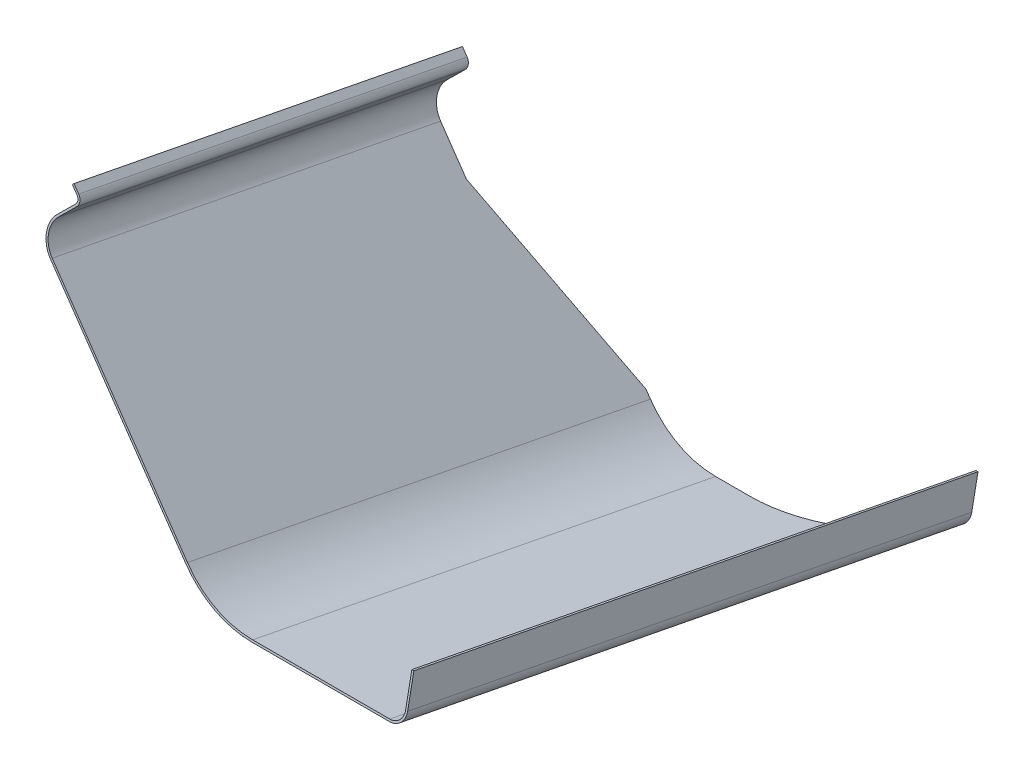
ISO-10303-21;
HEADER;
FILE_DESCRIPTION(('STEP AP214'),'2;1');
FILE_NAME('part.step','',(''),(''),'','','');
FILE_SCHEMA(('AUTOMOTIVE_DESIGN { 1 0 10303 214 1 1 1 1 }'));
ENDSEC;
DATA;
#1=APPLICATION_CONTEXT('core data for automotive mechanical design processes');
#2=APPLICATION_PROTOCOL_DEFINITION('international standard','automotive_design',2000,#1);
#3=PRODUCT_CONTEXT('',#1,'mechanical');
#4=PRODUCT('Part','Part','',(#3));
#5=PRODUCT_RELATED_PRODUCT_CATEGORY('part','',(#4));
#6=PRODUCT_DEFINITION_FORMATION('','',#4);
#7=PRODUCT_DEFINITION_CONTEXT('part definition',#1,'design');
#8=PRODUCT_DEFINITION('design','',#6,#7);
#9=PRODUCT_DEFINITION_SHAPE('','',#8);
#10=(LENGTH_UNIT() NAMED_UNIT(*) SI_UNIT(.MILLI.,.METRE.));
#11=(NAMED_UNIT(*) PLANE_ANGLE_UNIT() SI_UNIT($,.RADIAN.));
#12=(NAMED_UNIT(*) SI_UNIT($,.STERADIAN.) SOLID_ANGLE_UNIT());
#13=UNCERTAINTY_MEASURE_WITH_UNIT(LENGTH_MEASURE(1.E-05),#10,'distance_accuracy_value','');
#14=(GEOMETRIC_REPRESENTATION_CONTEXT(3) GLOBAL_UNCERTAINTY_ASSIGNED_CONTEXT((#13)) GLOBAL_UNIT_ASSIGNED_CONTEXT((#10,
#11,#12)) REPRESENTATION_CONTEXT('',''));
#15=CARTESIAN_POINT('',(0.,0.,0.));
#16=DIRECTION('',(0.,0.,1.));
#17=DIRECTION('',(1.,0.,0.));
#18=AXIS2_PLACEMENT_3D('',#15,#16,#17);
#19=CARTESIAN_POINT('',(-782.532323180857,-384.378000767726,-358.482205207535));
#20=DIRECTION('',(0.,0.190808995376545,0.981627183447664));
#21=DIRECTION('',(0.,-0.981627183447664,0.190808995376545));
#22=AXIS2_PLACEMENT_3D('',#19,#20,#21);
#23=PLANE('',#22);
#24=DIRECTION('',(0.,-0.981627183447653,0.190808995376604));
#25=VECTOR('',#24,1.);
#26=CARTESIAN_POINT('',(-782.532323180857,-324.520915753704,-370.117243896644));
#27=LINE('',#26,#25);
#28=CARTESIAN_POINT('',(-782.532323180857,-324.520915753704,-370.117243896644));
#29=VERTEX_POINT('',#28);
#30=CARTESIAN_POINT('',(-782.532323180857,-325.226136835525,-369.980162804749));
#31=VERTEX_POINT('',#30);
#32=EDGE_CURVE('E219',#29,#31,#27,.T.);
#33=ORIENTED_EDGE('',*,*,#32,.T.);
#34=DIRECTION('',(0.707106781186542,-0.694115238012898,0.134922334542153));
#35=VECTOR('',#34,1.);
#36=CARTESIAN_POINT('',(-790.791429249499,-317.118773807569,-371.556074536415));
#37=LINE('',#36,#35);
#38=CARTESIAN_POINT('',(-790.791429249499,-317.118773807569,-371.556074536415));
#39=VERTEX_POINT('',#38);
#40=EDGE_CURVE('E221',#39,#31,#37,.T.);
#41=ORIENTED_EDGE('',*,*,#40,.F.);
#42=CARTESIAN_POINT('',(-786.301301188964,-312.711142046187,-372.412831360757));
#43=DIRECTION('',(0.,-0.190808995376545,-0.981627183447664));
#44=DIRECTION('',(0.,0.981627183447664,-0.190808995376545));
#45=AXIS2_PLACEMENT_3D('',#42,#43,#44);
#46=CIRCLE('',#45,6.35000000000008);
#47=CARTESIAN_POINT('',(-790.791429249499,-308.303510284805,-373.2695881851));
#48=VERTEX_POINT('',#47);
#49=EDGE_CURVE('E312',#48,#39,#46,.F.);
#50=ORIENTED_EDGE('',*,*,#49,.F.);
#51=DIRECTION('',(-0.707106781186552,-0.694115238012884,0.134922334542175));
#52=VECTOR('',#51,1.);
#53=CARTESIAN_POINT('',(-786.983060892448,-304.565112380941,-373.996259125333));
#54=LINE('',#53,#52);
#55=CARTESIAN_POINT('',(-786.983060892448,-304.565112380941,-373.996259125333));
#56=VERTEX_POINT('',#55);
#57=EDGE_CURVE('E245',#56,#48,#54,.T.);
#58=ORIENTED_EDGE('',*,*,#57,.F.);
#59=CARTESIAN_POINT('',(-787.881086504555,-303.683586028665,-374.167610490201));
#60=DIRECTION('',(0.,-0.190808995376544,-0.981627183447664));
#61=DIRECTION('',(0.,0.981627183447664,-0.190808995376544));
#62=AXIS2_PLACEMENT_3D('',#59,#60,#61);
#63=CIRCLE('',#62,1.26999999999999);
#64=CARTESIAN_POINT('',(-786.983060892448,-302.802059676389,-374.33896185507));
#65=VERTEX_POINT('',#64);
#66=EDGE_CURVE('E249',#65,#56,#63,.T.);
#67=ORIENTED_EDGE('',*,*,#66,.F.);
#68=DIRECTION('',(0.707106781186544,-0.694115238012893,0.134922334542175));
#69=VECTOR('',#68,1.);
#70=CARTESIAN_POINT('',(-788.419901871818,-301.391617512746,-374.61312403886));
#71=LINE('',#70,#69);
#72=CARTESIAN_POINT('',(-788.419901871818,-301.391617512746,-374.61312403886));
#73=VERTEX_POINT('',#72);
#74=EDGE_CURVE('E250',#73,#65,#71,.T.);
#75=ORIENTED_EDGE('',*,*,#74,.F.);
#76=DIRECTION('',(-0.707106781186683,-0.694115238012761,0.134922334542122));
#77=VECTOR('',#76,1.);
#78=CARTESIAN_POINT('',(-788.060691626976,-301.039006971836,-374.681664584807));
#79=LINE('',#78,#77);
#80=CARTESIAN_POINT('',(-788.060691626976,-301.039006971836,-374.681664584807));
#81=VERTEX_POINT('',#80);
#82=EDGE_CURVE('E257',#81,#73,#79,.T.);
#83=ORIENTED_EDGE('',*,*,#82,.F.);
#84=DIRECTION('',(-0.707106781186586,0.694115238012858,-0.134922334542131));
#85=VECTOR('',#84,1.);
#86=CARTESIAN_POINT('',(-786.623850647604,-302.449449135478,-374.407502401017));
#87=LINE('',#86,#85);
#88=CARTESIAN_POINT('',(-786.623850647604,-302.449449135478,-374.407502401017));
#89=VERTEX_POINT('',#88);
#90=EDGE_CURVE('E263',#89,#81,#87,.T.);
#91=ORIENTED_EDGE('',*,*,#90,.F.);
#92=CARTESIAN_POINT('',(-787.881086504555,-303.683586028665,-374.167610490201));
#93=DIRECTION('',(0.,-0.190808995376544,-0.981627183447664));
#94=DIRECTION('',(0.,0.981627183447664,-0.190808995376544));
#95=AXIS2_PLACEMENT_3D('',#92,#93,#94);
#96=CIRCLE('',#95,1.77799999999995);
#97=CARTESIAN_POINT('',(-786.623850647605,-304.917722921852,-373.927718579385));
#98=VERTEX_POINT('',#97);
#99=EDGE_CURVE('E161',#98,#89,#96,.F.);
#100=ORIENTED_EDGE('',*,*,#99,.F.);
#101=DIRECTION('',(0.707106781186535,0.694115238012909,-0.134922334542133));
#102=VECTOR('',#101,1.);
#103=CARTESIAN_POINT('',(-790.432219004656,-308.656120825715,-373.201047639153));
#104=LINE('',#103,#102);
#105=CARTESIAN_POINT('',(-790.432219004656,-308.656120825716,-373.201047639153));
#106=VERTEX_POINT('',#105);
#107=EDGE_CURVE('E155',#106,#98,#104,.T.);
#108=ORIENTED_EDGE('',*,*,#107,.F.);
#109=CARTESIAN_POINT('',(-786.301301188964,-312.711142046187,-372.412831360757));
#110=DIRECTION('',(0.,-0.190808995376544,-0.981627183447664));
#111=DIRECTION('',(0.,0.981627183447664,-0.190808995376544));
#112=AXIS2_PLACEMENT_3D('',#109,#110,#111);
#113=CIRCLE('',#112,5.84200000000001);
#114=CARTESIAN_POINT('',(-790.432219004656,-316.766163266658,-371.624615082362));
#115=VERTEX_POINT('',#114);
#116=EDGE_CURVE('E20',#115,#106,#113,.T.);
#117=ORIENTED_EDGE('',*,*,#116,.F.);
#118=DIRECTION('',(-0.707106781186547,0.694115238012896,-0.134922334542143));
#119=VECTOR('',#118,1.);
#120=CARTESIAN_POINT('',(-782.532323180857,-324.520915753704,-370.117243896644));
#121=LINE('',#120,#119);
#122=EDGE_CURVE('E186',#29,#115,#121,.T.);
#123=ORIENTED_EDGE('',*,*,#122,.F.);
#124=EDGE_LOOP('',(#33,#41,#50,#58,#67,#75,#83,#91,#100,#108,#117,#123));
#125=FACE_BOUND('',#124,.T.);
#126=ADVANCED_FACE('F16',(#125),#23,.F.);
#127=CARTESIAN_POINT('',(-697.191345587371,-342.697312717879,-266.377108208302));
#128=DIRECTION('',(0.,-0.190808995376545,-0.981627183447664));
#129=DIRECTION('',(0.,0.981627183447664,-0.190808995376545));
#130=AXIS2_PLACEMENT_3D('',#127,#128,#129);
#131=CYLINDRICAL_SURFACE('',#130,3.80999999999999);
#132=DIRECTION('',(0.,-0.190808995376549,-0.981627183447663));
#133=VECTOR('',#132,1.);
#134=CARTESIAN_POINT('',(-693.381345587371,-342.697312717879,-266.377108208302));
#135=LINE('',#134,#133);
#136=CARTESIAN_POINT('',(-693.381345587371,-342.697312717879,-266.377108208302));
#137=VERTEX_POINT('',#136);
#138=CARTESIAN_POINT('',(-693.381345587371,-369.959147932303,-406.627092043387));
#139=VERTEX_POINT('',#138);
#140=EDGE_CURVE('E204',#137,#139,#135,.T.);
#141=ORIENTED_EDGE('',*,*,#140,.F.);
#142=CARTESIAN_POINT('',(-697.191345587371,-342.697312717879,-266.377108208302));
#143=DIRECTION('',(0.,-0.190808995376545,-0.981627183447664));
#144=DIRECTION('',(0.,0.981627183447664,-0.190808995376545));
#145=AXIS2_PLACEMENT_3D('',#142,#143,#144);
#146=CIRCLE('',#145,3.80999999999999);
#147=CARTESIAN_POINT('',(-697.191345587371,-346.437312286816,-265.650125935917));
#148=VERTEX_POINT('',#147);
#149=EDGE_CURVE('E298',#148,#137,#146,.F.);
#150=ORIENTED_EDGE('',*,*,#149,.F.);
#151=DIRECTION('',(0.,-0.190808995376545,-0.981627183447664));
#152=VECTOR('',#151,1.);
#153=CARTESIAN_POINT('',(-697.191345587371,-346.437312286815,-265.650125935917));
#154=LINE('',#153,#152);
#155=CARTESIAN_POINT('',(-697.191345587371,-373.699147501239,-405.900109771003));
#156=VERTEX_POINT('',#155);
#157=EDGE_CURVE('E209',#156,#148,#154,.F.);
#158=ORIENTED_EDGE('',*,*,#157,.F.);
#159=CARTESIAN_POINT('',(-697.191345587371,-369.959147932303,-406.627092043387));
#160=DIRECTION('',(0.,-0.190808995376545,-0.981627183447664));
#161=DIRECTION('',(0.,0.981627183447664,-0.190808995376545));
#162=AXIS2_PLACEMENT_3D('',#159,#160,#161);
#163=CIRCLE('',#162,3.80999999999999);
#164=EDGE_CURVE('E310',#156,#139,#163,.F.);
#165=ORIENTED_EDGE('',*,*,#164,.T.);
#166=EDGE_LOOP('',(#141,#150,#158,#165));
#167=FACE_BOUND('',#166,.T.);
#168=ADVANCED_FACE('F461',(#167),#131,.T.);
#169=CARTESIAN_POINT('',(-693.381345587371,-342.697312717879,-266.377108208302));
#170=DIRECTION('',(1.,0.,0.));
#171=DIRECTION('',(0.,1.,0.));
#172=AXIS2_PLACEMENT_3D('',#169,#170,#171);
#173=PLANE('',#172);
#174=DIRECTION('',(0.,-0.981627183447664,0.190808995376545));
#175=VECTOR('',#174,1.);
#176=CARTESIAN_POINT('',(-693.381345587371,-315.518055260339,-271.660220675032));
#177=LINE('',#176,#175);
#178=CARTESIAN_POINT('',(-693.381345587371,-334.730907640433,-267.925620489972));
#179=VERTEX_POINT('',#178);
#180=EDGE_CURVE('E199',#137,#179,#177,.F.);
#181=ORIENTED_EDGE('',*,*,#180,.F.);
#182=ORIENTED_EDGE('',*,*,#140,.T.);
#183=DIRECTION('',(0.,-0.981627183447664,0.190808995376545));
#184=VECTOR('',#183,1.);
#185=CARTESIAN_POINT('',(-693.381345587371,-366.396344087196,-407.319630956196));
#186=LINE('',#185,#184);
#187=CARTESIAN_POINT('',(-693.381345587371,-361.992742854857,-408.175604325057));
#188=VERTEX_POINT('',#187);
#189=EDGE_CURVE('E242',#139,#188,#186,.F.);
#190=ORIENTED_EDGE('',*,*,#189,.T.);
#191=DIRECTION('',(0.,0.190808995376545,0.981627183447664));
#192=VECTOR('',#191,1.);
#193=CARTESIAN_POINT('',(-693.381345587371,-334.730907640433,-267.925620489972));
#194=LINE('',#193,#192);
#195=EDGE_CURVE('E192',#179,#188,#194,.F.);
#196=ORIENTED_EDGE('',*,*,#195,.F.);
#197=EDGE_LOOP('',(#181,#182,#190,#196));
#198=FACE_BOUND('',#197,.T.);
#199=ADVANCED_FACE('F696',(#198),#173,.T.);
#200=CARTESIAN_POINT('',(-693.381345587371,-334.730907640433,-267.925620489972));
#201=DIRECTION('',(0.,0.981627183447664,-0.190808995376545));
#202=DIRECTION('',(0.,0.190808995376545,0.981627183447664));
#203=AXIS2_PLACEMENT_3D('',#200,#201,#202);
#204=PLANE('',#203);
#205=DIRECTION('',(1.,0.,0.));
#206=VECTOR('',#205,1.);
#207=CARTESIAN_POINT('',(-751.586870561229,-334.730907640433,-267.925620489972));
#208=LINE('',#207,#206);
#209=CARTESIAN_POINT('',(-693.889345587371,-334.730907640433,-267.925620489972));
#210=VERTEX_POINT('',#209);
#211=EDGE_CURVE('E195',#179,#210,#208,.F.);
#212=ORIENTED_EDGE('',*,*,#211,.F.);
#213=ORIENTED_EDGE('',*,*,#195,.T.);
#214=DIRECTION('',(1.,0.,0.));
#215=VECTOR('',#214,1.);
#216=CARTESIAN_POINT('',(-749.243235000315,-361.992742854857,-408.175604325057));
#217=LINE('',#216,#215);
#218=CARTESIAN_POINT('',(-693.889345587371,-361.992742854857,-408.175604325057));
#219=VERTEX_POINT('',#218);
#220=EDGE_CURVE('E238',#188,#219,#217,.F.);
#221=ORIENTED_EDGE('',*,*,#220,.T.);
#222=DIRECTION('',(0.,-0.190808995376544,-0.981627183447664));
#223=VECTOR('',#222,1.);
#224=CARTESIAN_POINT('',(-693.889345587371,-334.730907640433,-267.925620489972));
#225=LINE('',#224,#223);
#226=EDGE_CURVE('E189',#210,#219,#225,.T.);
#227=ORIENTED_EDGE('',*,*,#226,.F.);
#228=EDGE_LOOP('',(#212,#213,#221,#227));
#229=FACE_BOUND('',#228,.T.);
#230=ADVANCED_FACE('F456',(#229),#204,.T.);
#231=CARTESIAN_POINT('',(-693.889345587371,-334.730907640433,-267.925620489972));
#232=DIRECTION('',(-1.,0.,0.));
#233=DIRECTION('',(0.,-1.,0.));
#234=AXIS2_PLACEMENT_3D('',#231,#232,#233);
#235=PLANE('',#234);
#236=DIRECTION('',(0.,-0.981627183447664,0.190808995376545));
#237=VECTOR('',#236,1.);
#238=CARTESIAN_POINT('',(-693.889345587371,-315.518055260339,-271.660220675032));
#239=LINE('',#238,#237);
#240=CARTESIAN_POINT('',(-693.889345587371,-342.697312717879,-266.377108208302));
#241=VERTEX_POINT('',#240);
#242=EDGE_CURVE('E198',#210,#241,#239,.T.);
#243=ORIENTED_EDGE('',*,*,#242,.F.);
#244=ORIENTED_EDGE('',*,*,#226,.T.);
#245=DIRECTION('',(0.,-0.981627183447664,0.190808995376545));
#246=VECTOR('',#245,1.);
#247=CARTESIAN_POINT('',(-693.889345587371,-366.396344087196,-407.319630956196));
#248=LINE('',#247,#246);
#249=CARTESIAN_POINT('',(-693.889345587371,-369.959147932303,-406.627092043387));
#250=VERTEX_POINT('',#249);
#251=EDGE_CURVE('E241',#219,#250,#248,.T.);
#252=ORIENTED_EDGE('',*,*,#251,.T.);
#253=DIRECTION('',(0.,-0.190808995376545,-0.981627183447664));
#254=VECTOR('',#253,1.);
#255=CARTESIAN_POINT('',(-693.889345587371,-342.697312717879,-266.377108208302));
#256=LINE('',#255,#254);
#257=EDGE_CURVE('E174',#241,#250,#256,.T.);
#258=ORIENTED_EDGE('',*,*,#257,.F.);
#259=EDGE_LOOP('',(#243,#244,#252,#258));
#260=FACE_BOUND('',#259,.T.);
#261=ADVANCED_FACE('F438',(#260),#235,.T.);
#262=CARTESIAN_POINT('',(-786.301301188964,-293.942040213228,-275.85417314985));
#263=DIRECTION('',(0.,-0.190808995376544,-0.981627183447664));
#264=DIRECTION('',(0.,0.981627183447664,-0.190808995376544));
#265=AXIS2_PLACEMENT_3D('',#262,#263,#264);
#266=CYLINDRICAL_SURFACE('',#265,5.84200000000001);
#267=DIRECTION('',(0.,-0.190808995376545,-0.981627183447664));
#268=VECTOR('',#267,1.);
#269=CARTESIAN_POINT('',(-790.432219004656,-289.887018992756,-276.642389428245));
#270=LINE('',#269,#268);
#271=CARTESIAN_POINT('',(-790.432219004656,-289.887018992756,-276.642389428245));
#272=VERTEX_POINT('',#271);
#273=EDGE_CURVE('E166',#272,#106,#270,.T.);
#274=ORIENTED_EDGE('',*,*,#273,.F.);
#275=CARTESIAN_POINT('',(-786.301301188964,-293.942040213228,-275.85417314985));
#276=DIRECTION('',(0.,-0.190808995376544,-0.981627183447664));
#277=DIRECTION('',(0.,0.981627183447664,-0.190808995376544));
#278=AXIS2_PLACEMENT_3D('',#275,#276,#277);
#279=CIRCLE('',#278,5.84200000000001);
#280=CARTESIAN_POINT('',(-790.432219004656,-297.997061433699,-275.065956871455));
#281=VERTEX_POINT('',#280);
#282=EDGE_CURVE('E293',#281,#272,#279,.T.);
#283=ORIENTED_EDGE('',*,*,#282,.F.);
#284=DIRECTION('',(0.,0.190808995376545,0.981627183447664));
#285=VECTOR('',#284,1.);
#286=CARTESIAN_POINT('',(-790.432219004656,-316.766163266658,-371.624615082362));
#287=LINE('',#286,#285);
#288=EDGE_CURVE('E172',#115,#281,#287,.T.);
#289=ORIENTED_EDGE('',*,*,#288,.F.);
#290=ORIENTED_EDGE('',*,*,#116,.T.);
#291=EDGE_LOOP('',(#274,#283,#289,#290));
#292=FACE_BOUND('',#291,.T.);
#293=ADVANCED_FACE('F169',(#292),#266,.F.);
#294=CARTESIAN_POINT('',(-790.432219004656,-289.887018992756,-276.642389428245));
#295=DIRECTION('',(0.70710678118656,-0.694115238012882,0.134922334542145));
#296=DIRECTION('',(0.700520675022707,0.713632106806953,0.));
#297=AXIS2_PLACEMENT_3D('',#294,#295,#296);
#298=PLANE('',#297);
#299=DIRECTION('',(0.707106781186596,0.694115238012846,-0.134922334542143));
#300=VECTOR('',#299,1.);
#301=CARTESIAN_POINT('',(-790.432219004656,-289.887018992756,-276.642389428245));
#302=LINE('',#301,#300);
#303=CARTESIAN_POINT('',(-786.623850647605,-286.148621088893,-277.369060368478));
#304=VERTEX_POINT('',#303);
#305=EDGE_CURVE('E177',#272,#304,#302,.T.);
#306=ORIENTED_EDGE('',*,*,#305,.F.);
#307=ORIENTED_EDGE('',*,*,#273,.T.);
#308=ORIENTED_EDGE('',*,*,#107,.T.);
#309=DIRECTION('',(0.,-0.190808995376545,-0.981627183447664));
#310=VECTOR('',#309,1.);
#311=CARTESIAN_POINT('',(-786.623850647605,-286.148621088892,-277.369060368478));
#312=LINE('',#311,#310);
#313=EDGE_CURVE('E179',#304,#98,#312,.T.);
#314=ORIENTED_EDGE('',*,*,#313,.F.);
#315=EDGE_LOOP('',(#306,#307,#308,#314));
#316=FACE_BOUND('',#315,.T.);
#317=ADVANCED_FACE('F175',(#316),#298,.T.);
#318=CARTESIAN_POINT('',(-787.881086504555,-284.914484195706,-277.608952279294));
#319=DIRECTION('',(0.,-0.190808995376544,-0.981627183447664));
#320=DIRECTION('',(0.,0.981627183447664,-0.190808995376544));
#321=AXIS2_PLACEMENT_3D('',#318,#319,#320);
#322=CYLINDRICAL_SURFACE('',#321,1.77799999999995);
#323=DIRECTION('',(0.,-0.190808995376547,-0.981627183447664));
#324=VECTOR('',#323,1.);
#325=CARTESIAN_POINT('',(-786.623850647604,-283.680347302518,-277.84884419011));
#326=LINE('',#325,#324);
#327=CARTESIAN_POINT('',(-786.623850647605,-283.680347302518,-277.84884419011));
#328=VERTEX_POINT('',#327);
#329=EDGE_CURVE('E260',#328,#89,#326,.T.);
#330=ORIENTED_EDGE('',*,*,#329,.F.);
#331=CARTESIAN_POINT('',(-787.881086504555,-284.914484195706,-277.608952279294));
#332=DIRECTION('',(0.,-0.190808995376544,-0.981627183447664));
#333=DIRECTION('',(0.,0.981627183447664,-0.190808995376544));
#334=AXIS2_PLACEMENT_3D('',#331,#332,#333);
#335=CIRCLE('',#334,1.77799999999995);
#336=EDGE_CURVE('E289',#304,#328,#335,.F.);
#337=ORIENTED_EDGE('',*,*,#336,.F.);
#338=ORIENTED_EDGE('',*,*,#313,.T.);
#339=ORIENTED_EDGE('',*,*,#99,.T.);
#340=EDGE_LOOP('',(#330,#337,#338,#339));
#341=FACE_BOUND('',#340,.T.);
#342=ADVANCED_FACE('F320',(#341),#322,.T.);
#343=CARTESIAN_POINT('',(-786.623850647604,-283.680347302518,-277.84884419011));
#344=DIRECTION('',(0.707106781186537,0.694115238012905,-0.134922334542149));
#345=DIRECTION('',(-0.700520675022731,0.71363210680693,0.));
#346=AXIS2_PLACEMENT_3D('',#343,#344,#345);
#347=PLANE('',#346);
#348=DIRECTION('',(-0.707106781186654,0.694115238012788,-0.134922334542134));
#349=VECTOR('',#348,1.);
#350=CARTESIAN_POINT('',(-786.623850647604,-283.680347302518,-277.84884419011));
#351=LINE('',#350,#349);
#352=CARTESIAN_POINT('',(-788.060691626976,-282.269905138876,-278.1230063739));
#353=VERTEX_POINT('',#352);
#354=EDGE_CURVE('E292',#328,#353,#351,.T.);
#355=ORIENTED_EDGE('',*,*,#354,.F.);
#356=ORIENTED_EDGE('',*,*,#329,.T.);
#357=ORIENTED_EDGE('',*,*,#90,.T.);
#358=DIRECTION('',(0.,-0.190808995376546,-0.981627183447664));
#359=VECTOR('',#358,1.);
#360=CARTESIAN_POINT('',(-788.060691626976,-282.269905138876,-278.1230063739));
#361=LINE('',#360,#359);
#362=EDGE_CURVE('E254',#353,#81,#361,.T.);
#363=ORIENTED_EDGE('',*,*,#362,.F.);
#364=EDGE_LOOP('',(#355,#356,#357,#363));
#365=FACE_BOUND('',#364,.T.);
#366=ADVANCED_FACE('F323',(#365),#347,.T.);
#367=CARTESIAN_POINT('',(-788.060691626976,-282.269905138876,-278.1230063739));
#368=DIRECTION('',(-0.707106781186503,0.694115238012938,-0.134922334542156));
#369=DIRECTION('',(-0.700520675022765,-0.713632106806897,0.));
#370=AXIS2_PLACEMENT_3D('',#367,#368,#369);
#371=PLANE('',#370);
#372=DIRECTION('',(-0.707106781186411,-0.694115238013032,0.134922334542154));
#373=VECTOR('',#372,1.);
#374=CARTESIAN_POINT('',(-788.060691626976,-282.269905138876,-278.1230063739));
#375=LINE('',#374,#373);
#376=CARTESIAN_POINT('',(-788.419901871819,-282.622515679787,-278.054465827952));
#377=VERTEX_POINT('',#376);
#378=EDGE_CURVE('E333',#353,#377,#375,.T.);
#379=ORIENTED_EDGE('',*,*,#378,.F.);
#380=ORIENTED_EDGE('',*,*,#362,.T.);
#381=ORIENTED_EDGE('',*,*,#82,.T.);
#382=DIRECTION('',(0.,-0.190808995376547,-0.981627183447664));
#383=VECTOR('',#382,1.);
#384=CARTESIAN_POINT('',(-788.419901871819,-282.622515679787,-278.054465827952));
#385=LINE('',#384,#383);
#386=EDGE_CURVE('E253',#377,#73,#385,.T.);
#387=ORIENTED_EDGE('',*,*,#386,.F.);
#388=EDGE_LOOP('',(#379,#380,#381,#387));
#389=FACE_BOUND('',#388,.T.);
#390=ADVANCED_FACE('F495',(#389),#371,.T.);
#391=CARTESIAN_POINT('',(-788.419901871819,-282.622515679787,-278.054465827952));
#392=DIRECTION('',(-0.707106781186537,-0.694115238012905,0.134922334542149));
#393=DIRECTION('',(0.700520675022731,-0.71363210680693,0.));
#394=AXIS2_PLACEMENT_3D('',#391,#392,#393);
#395=PLANE('',#394);
#396=DIRECTION('',(0.707106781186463,-0.694115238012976,0.13492233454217));
#397=VECTOR('',#396,1.);
#398=CARTESIAN_POINT('',(-788.419901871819,-282.622515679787,-278.054465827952));
#399=LINE('',#398,#397);
#400=CARTESIAN_POINT('',(-786.983060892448,-284.032957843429,-277.780303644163));
#401=VERTEX_POINT('',#400);
#402=EDGE_CURVE('E288',#377,#401,#399,.T.);
#403=ORIENTED_EDGE('',*,*,#402,.F.);
#404=ORIENTED_EDGE('',*,*,#386,.T.);
#405=ORIENTED_EDGE('',*,*,#74,.T.);
#406=DIRECTION('',(0.,-0.190808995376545,-0.981627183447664));
#407=VECTOR('',#406,1.);
#408=CARTESIAN_POINT('',(-786.983060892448,-284.032957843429,-277.780303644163));
#409=LINE('',#408,#407);
#410=EDGE_CURVE('E317',#401,#65,#409,.T.);
#411=ORIENTED_EDGE('',*,*,#410,.F.);
#412=EDGE_LOOP('',(#403,#404,#405,#411));
#413=FACE_BOUND('',#412,.T.);
#414=ADVANCED_FACE('F498',(#413),#395,.T.);
#415=CARTESIAN_POINT('',(-787.881086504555,-284.914484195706,-277.608952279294));
#416=DIRECTION('',(0.,-0.190808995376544,-0.981627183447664));
#417=DIRECTION('',(0.,0.981627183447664,-0.190808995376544));
#418=AXIS2_PLACEMENT_3D('',#415,#416,#417);
#419=CYLINDRICAL_SURFACE('',#418,1.26999999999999);
#420=DIRECTION('',(0.,-0.190808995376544,-0.981627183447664));
#421=VECTOR('',#420,1.);
#422=CARTESIAN_POINT('',(-786.983060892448,-285.796010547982,-277.437600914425));
#423=LINE('',#422,#421);
#424=CARTESIAN_POINT('',(-786.983060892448,-285.796010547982,-277.437600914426));
#425=VERTEX_POINT('',#424);
#426=EDGE_CURVE('E248',#425,#56,#423,.T.);
#427=ORIENTED_EDGE('',*,*,#426,.F.);
#428=CARTESIAN_POINT('',(-787.881086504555,-284.914484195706,-277.608952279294));
#429=DIRECTION('',(0.,-0.190808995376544,-0.981627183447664));
#430=DIRECTION('',(0.,0.981627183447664,-0.190808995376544));
#431=AXIS2_PLACEMENT_3D('',#428,#429,#430);
#432=CIRCLE('',#431,1.26999999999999);
#433=EDGE_CURVE('E285',#401,#425,#432,.T.);
#434=ORIENTED_EDGE('',*,*,#433,.F.);
#435=ORIENTED_EDGE('',*,*,#410,.T.);
#436=ORIENTED_EDGE('',*,*,#66,.T.);
#437=EDGE_LOOP('',(#427,#434,#435,#436));
#438=FACE_BOUND('',#437,.T.);
#439=ADVANCED_FACE('F519',(#438),#419,.F.);
#440=CARTESIAN_POINT('',(-786.983060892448,-285.796010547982,-277.437600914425));
#441=DIRECTION('',(-0.707106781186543,0.694115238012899,-0.134922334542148));
#442=DIRECTION('',(-0.700520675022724,-0.713632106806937,0.));
#443=AXIS2_PLACEMENT_3D('',#440,#441,#442);
#444=PLANE('',#443);
#445=DIRECTION('',(-0.707106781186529,-0.694115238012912,0.134922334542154));
#446=VECTOR('',#445,1.);
#447=CARTESIAN_POINT('',(-786.983060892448,-285.796010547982,-277.437600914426));
#448=LINE('',#447,#446);
#449=CARTESIAN_POINT('',(-790.791429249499,-289.534408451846,-276.710929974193));
#450=VERTEX_POINT('',#449);
#451=EDGE_CURVE('E284',#425,#450,#448,.T.);
#452=ORIENTED_EDGE('',*,*,#451,.F.);
#453=ORIENTED_EDGE('',*,*,#426,.T.);
#454=ORIENTED_EDGE('',*,*,#57,.T.);
#455=DIRECTION('',(0.,-0.190808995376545,-0.981627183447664));
#456=VECTOR('',#455,1.);
#457=CARTESIAN_POINT('',(-790.791429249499,-289.534408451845,-276.710929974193));
#458=LINE('',#457,#456);
#459=EDGE_CURVE('E315',#450,#48,#458,.T.);
#460=ORIENTED_EDGE('',*,*,#459,.F.);
#461=EDGE_LOOP('',(#452,#453,#454,#460));
#462=FACE_BOUND('',#461,.T.);
#463=ADVANCED_FACE('F517',(#462),#444,.T.);
#464=CARTESIAN_POINT('',(-786.301301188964,-293.942040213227,-275.85417314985));
#465=DIRECTION('',(0.,-0.190808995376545,-0.981627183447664));
#466=DIRECTION('',(0.,0.981627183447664,-0.190808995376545));
#467=AXIS2_PLACEMENT_3D('',#464,#465,#466);
#468=CYLINDRICAL_SURFACE('',#467,6.35000000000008);
#469=DIRECTION('',(0.,-0.190808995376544,-0.981627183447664));
#470=VECTOR('',#469,1.);
#471=CARTESIAN_POINT('',(-790.791429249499,-298.349671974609,-274.997416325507));
#472=LINE('',#471,#470);
#473=CARTESIAN_POINT('',(-790.791429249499,-298.349671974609,-274.997416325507));
#474=VERTEX_POINT('',#473);
#475=EDGE_CURVE('E214',#474,#39,#472,.T.);
#476=ORIENTED_EDGE('',*,*,#475,.F.);
#477=CARTESIAN_POINT('',(-786.301301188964,-293.942040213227,-275.85417314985));
#478=DIRECTION('',(0.,-0.190808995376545,-0.981627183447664));
#479=DIRECTION('',(0.,0.981627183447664,-0.190808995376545));
#480=AXIS2_PLACEMENT_3D('',#477,#478,#479);
#481=CIRCLE('',#480,6.35000000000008);
#482=EDGE_CURVE('E280',#450,#474,#481,.F.);
#483=ORIENTED_EDGE('',*,*,#482,.F.);
#484=ORIENTED_EDGE('',*,*,#459,.T.);
#485=ORIENTED_EDGE('',*,*,#49,.T.);
#486=EDGE_LOOP('',(#476,#483,#484,#485));
#487=FACE_BOUND('',#486,.T.);
#488=ADVANCED_FACE('F513',(#487),#468,.T.);
#489=CARTESIAN_POINT('',(-697.191345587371,-342.697312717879,-266.377108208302));
#490=DIRECTION('',(0.,-0.190808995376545,-0.981627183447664));
#491=DIRECTION('',(0.,0.981627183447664,-0.190808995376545));
#492=AXIS2_PLACEMENT_3D('',#489,#490,#491);
#493=CYLINDRICAL_SURFACE('',#492,3.30199999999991);
#494=DIRECTION('',(0.,0.190808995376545,0.981627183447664));
#495=VECTOR('',#494,1.);
#496=CARTESIAN_POINT('',(-697.191345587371,-345.938645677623,-265.747056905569));
#497=LINE('',#496,#495);
#498=CARTESIAN_POINT('',(-697.191345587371,-345.938645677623,-265.747056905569));
#499=VERTEX_POINT('',#498);
#500=CARTESIAN_POINT('',(-697.191345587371,-373.200480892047,-405.997040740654));
#501=VERTEX_POINT('',#500);
#502=EDGE_CURVE('E346',#499,#501,#497,.F.);
#503=ORIENTED_EDGE('',*,*,#502,.F.);
#504=CARTESIAN_POINT('',(-697.191345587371,-342.697312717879,-266.377108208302));
#505=DIRECTION('',(0.,-0.190808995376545,-0.981627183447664));
#506=DIRECTION('',(0.,0.981627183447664,-0.190808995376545));
#507=AXIS2_PLACEMENT_3D('',#504,#505,#506);
#508=CIRCLE('',#507,3.30199999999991);
#509=EDGE_CURVE('E296',#241,#499,#508,.T.);
#510=ORIENTED_EDGE('',*,*,#509,.F.);
#511=ORIENTED_EDGE('',*,*,#257,.T.);
#512=CARTESIAN_POINT('',(-697.191345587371,-369.959147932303,-406.627092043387));
#513=DIRECTION('',(0.,-0.190808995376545,-0.981627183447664));
#514=DIRECTION('',(0.,0.981627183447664,-0.190808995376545));
#515=AXIS2_PLACEMENT_3D('',#512,#513,#514);
#516=CIRCLE('',#515,3.30199999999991);
#517=EDGE_CURVE('E307',#250,#501,#516,.T.);
#518=ORIENTED_EDGE('',*,*,#517,.T.);
#519=EDGE_LOOP('',(#503,#510,#511,#518));
#520=FACE_BOUND('',#519,.T.);
#521=ADVANCED_FACE('F444',(#520),#493,.F.);
#522=CARTESIAN_POINT('',(-749.243235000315,-366.396344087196,-407.319630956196));
#523=DIRECTION('',(0.,0.190808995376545,0.981627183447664));
#524=DIRECTION('',(0.,-0.981627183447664,0.190808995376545));
#525=AXIS2_PLACEMENT_3D('',#522,#523,#524);
#526=PLANE('',#525);
#527=DIRECTION('',(1.,0.,0.));
#528=VECTOR('',#527,1.);
#529=CARTESIAN_POINT('',(-697.191345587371,-373.200480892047,-405.997040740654));
#530=LINE('',#529,#528);
#531=CARTESIAN_POINT('',(-697.35633406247,-373.200480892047,-405.997040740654));
#532=VERTEX_POINT('',#531);
#533=EDGE_CURVE('E349',#501,#532,#530,.F.);
#534=ORIENTED_EDGE('',*,*,#533,.F.);
#535=ORIENTED_EDGE('',*,*,#517,.F.);
#536=ORIENTED_EDGE('',*,*,#251,.F.);
#537=ORIENTED_EDGE('',*,*,#220,.F.);
#538=ORIENTED_EDGE('',*,*,#189,.F.);
#539=ORIENTED_EDGE('',*,*,#164,.F.);
#540=DIRECTION('',(1.,0.,0.));
#541=VECTOR('',#540,1.);
#542=CARTESIAN_POINT('',(-731.282722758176,-373.69914750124,-405.900109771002));
#543=LINE('',#542,#541);
#544=CARTESIAN_POINT('',(-697.35633406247,-373.699147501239,-405.900109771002));
#545=VERTEX_POINT('',#544);
#546=EDGE_CURVE('E213',#545,#156,#543,.T.);
#547=ORIENTED_EDGE('',*,*,#546,.F.);
#548=DIRECTION('',(0.,0.981627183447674,-0.190808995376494));
#549=VECTOR('',#548,1.);
#550=CARTESIAN_POINT('',(-697.35633406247,-373.699147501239,-405.900109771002));
#551=LINE('',#550,#549);
#552=EDGE_CURVE('E309',#545,#532,#551,.T.);
#553=ORIENTED_EDGE('',*,*,#552,.T.);
#554=EDGE_LOOP('',(#534,#535,#536,#537,#538,#539,#547,#553));
#555=FACE_BOUND('',#554,.T.);
#556=ADVANCED_FACE('F457',(#555),#526,.F.);
#557=CARTESIAN_POINT('',(-697.35633406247,-397.424177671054,-425.598966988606));
#558=DIRECTION('',(1.,0.,0.));
#559=DIRECTION('',(0.,0.,-1.));
#560=AXIS2_PLACEMENT_3D('',#557,#558,#559);
#561=PLANE('',#560);
#562=ORIENTED_EDGE('',*,*,#552,.F.);
#563=DIRECTION('',(0.,-0.190808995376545,-0.981627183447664));
#564=VECTOR('',#563,1.);
#565=CARTESIAN_POINT('',(-697.35633406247,-346.437312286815,-265.650125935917));
#566=LINE('',#565,#564);
#567=CARTESIAN_POINT('',(-697.35633406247,-373.658689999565,-405.691973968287));
#568=VERTEX_POINT('',#567);
#569=EDGE_CURVE('E231',#568,#545,#566,.T.);
#570=ORIENTED_EDGE('',*,*,#569,.F.);
#571=DIRECTION('',(0.,0.981627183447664,-0.190808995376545));
#572=VECTOR('',#571,1.);
#573=CARTESIAN_POINT('',(-697.35633406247,-392.830276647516,-401.965395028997));
#574=LINE('',#573,#572);
#575=CARTESIAN_POINT('',(-697.35633406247,-373.160023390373,-405.788904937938));
#576=VERTEX_POINT('',#575);
#577=EDGE_CURVE('E222',#568,#576,#574,.T.);
#578=ORIENTED_EDGE('',*,*,#577,.T.);
#579=DIRECTION('',(0.,0.190808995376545,0.981627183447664));
#580=VECTOR('',#579,1.);
#581=CARTESIAN_POINT('',(-697.35633406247,-345.938645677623,-265.747056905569));
#582=LINE('',#581,#580);
#583=EDGE_CURVE('E279',#532,#576,#582,.T.);
#584=ORIENTED_EDGE('',*,*,#583,.F.);
#585=EDGE_LOOP('',(#562,#570,#578,#584));
#586=FACE_BOUND('',#585,.T.);
#587=ADVANCED_FACE('F471',(#586),#561,.F.);
#588=CARTESIAN_POINT('',(-750.24787632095,-387.983728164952,-377.032064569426));
#589=DIRECTION('',(0.505156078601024,0.164673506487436,0.847171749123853));
#590=DIRECTION('',(0.858897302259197,0.,-0.512147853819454));
#591=AXIS2_PLACEMENT_3D('',#588,#589,#590);
#592=PLANE('',#591);
#593=DIRECTION('',(0.,-0.981627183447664,0.190808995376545));
#594=VECTOR('',#593,1.);
#595=CARTESIAN_POINT('',(-750.24787632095,-387.983728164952,-377.032064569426));
#596=LINE('',#595,#594);
#597=CARTESIAN_POINT('',(-750.24787632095,-359.817933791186,-382.506940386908));
#598=VERTEX_POINT('',#597);
#599=CARTESIAN_POINT('',(-750.24787632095,-360.523154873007,-382.369859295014));
#600=VERTEX_POINT('',#599);
#601=EDGE_CURVE('E278',#598,#600,#596,.T.);
#602=ORIENTED_EDGE('',*,*,#601,.T.);
#603=DIRECTION('',(0.653356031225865,-0.714322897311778,-0.250736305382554));
#604=VECTOR('',#603,1.);
#605=CARTESIAN_POINT('',(-782.532323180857,-325.226136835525,-369.980162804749));
#606=LINE('',#605,#604);
#607=EDGE_CURVE('E218',#31,#600,#606,.T.);
#608=ORIENTED_EDGE('',*,*,#607,.F.);
#609=ORIENTED_EDGE('',*,*,#32,.F.);
#610=DIRECTION('',(-0.653356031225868,0.714322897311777,0.25073630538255));
#611=VECTOR('',#610,1.);
#612=CARTESIAN_POINT('',(-750.24787632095,-359.817933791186,-382.506940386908));
#613=LINE('',#612,#611);
#614=EDGE_CURVE('E185',#598,#29,#613,.T.);
#615=ORIENTED_EDGE('',*,*,#614,.F.);
#616=EDGE_LOOP('',(#602,#608,#609,#615));
#617=FACE_BOUND('',#616,.T.);
#618=ADVANCED_FACE('F507',(#617),#592,.F.);
#619=CARTESIAN_POINT('',(-790.791429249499,-298.349671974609,-274.997416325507));
#620=DIRECTION('',(-0.707106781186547,-0.694115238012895,0.134922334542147));
#621=DIRECTION('',(0.700520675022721,-0.71363210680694,0.));
#622=AXIS2_PLACEMENT_3D('',#619,#620,#621);
#623=PLANE('',#622);
#624=DIRECTION('',(0.707106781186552,-0.69411523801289,0.134922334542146));
#625=VECTOR('',#624,1.);
#626=CARTESIAN_POINT('',(-790.791429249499,-298.349671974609,-274.997416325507));
#627=LINE('',#626,#625);
#628=CARTESIAN_POINT('',(-749.243235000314,-339.134508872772,-267.069647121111));
#629=VERTEX_POINT('',#628);
#630=EDGE_CURVE('E305',#474,#629,#627,.T.);
#631=ORIENTED_EDGE('',*,*,#630,.F.);
#632=ORIENTED_EDGE('',*,*,#475,.T.);
#633=ORIENTED_EDGE('',*,*,#40,.T.);
#634=ORIENTED_EDGE('',*,*,#607,.T.);
#635=DIRECTION('',(0.707106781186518,-0.694115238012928,0.134922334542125));
#636=VECTOR('',#635,1.);
#637=CARTESIAN_POINT('',(-750.24787632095,-360.523154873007,-382.369859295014));
#638=LINE('',#637,#636);
#639=CARTESIAN_POINT('',(-749.243235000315,-361.509338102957,-382.178164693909));
#640=VERTEX_POINT('',#639);
#641=EDGE_CURVE('E275',#600,#640,#638,.T.);
#642=ORIENTED_EDGE('',*,*,#641,.T.);
#643=DIRECTION('',(0.,-0.190808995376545,-0.981627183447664));
#644=VECTOR('',#643,1.);
#645=CARTESIAN_POINT('',(-749.243235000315,-339.134508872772,-267.069647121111));
#646=LINE('',#645,#644);
#647=EDGE_CURVE('E217',#629,#640,#646,.T.);
#648=ORIENTED_EDGE('',*,*,#647,.F.);
#649=EDGE_LOOP('',(#631,#632,#633,#634,#642,#648));
#650=FACE_BOUND('',#649,.T.);
#651=ADVANCED_FACE('F511',(#650),#623,.T.);
#652=CARTESIAN_POINT('',(-731.282722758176,-321.503981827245,-270.496674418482));
#653=DIRECTION('',(0.,-0.190808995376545,-0.981627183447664));
#654=DIRECTION('',(0.,0.981627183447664,-0.190808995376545));
#655=AXIS2_PLACEMENT_3D('',#652,#653,#654);
#656=CYLINDRICAL_SURFACE('',#655,25.4);
#657=DIRECTION('',(0.,-0.190808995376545,-0.981627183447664));
#658=VECTOR('',#657,1.);
#659=CARTESIAN_POINT('',(-731.282722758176,-346.437312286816,-265.650125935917));
#660=LINE('',#659,#658);
#661=CARTESIAN_POINT('',(-731.282722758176,-346.437312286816,-265.650125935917));
#662=VERTEX_POINT('',#661);
#663=CARTESIAN_POINT('',(-731.282722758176,-368.812141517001,-380.758643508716));
#664=VERTEX_POINT('',#663);
#665=EDGE_CURVE('E212',#662,#664,#660,.T.);
#666=ORIENTED_EDGE('',*,*,#665,.F.);
#667=CARTESIAN_POINT('',(-731.282722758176,-321.503981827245,-270.496674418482));
#668=DIRECTION('',(0.,-0.190808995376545,-0.981627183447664));
#669=DIRECTION('',(0.,0.981627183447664,-0.190808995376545));
#670=AXIS2_PLACEMENT_3D('',#667,#668,#669);
#671=CIRCLE('',#670,25.4);
#672=EDGE_CURVE('E302',#629,#662,#671,.F.);
#673=ORIENTED_EDGE('',*,*,#672,.F.);
#674=ORIENTED_EDGE('',*,*,#647,.T.);
#675=CARTESIAN_POINT('',(-731.282722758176,-343.87881105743,-385.60519199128));
#676=DIRECTION('',(0.,-0.190808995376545,-0.981627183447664));
#677=DIRECTION('',(0.,0.981627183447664,-0.190808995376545));
#678=AXIS2_PLACEMENT_3D('',#675,#676,#677);
#679=CIRCLE('',#678,25.4);
#680=EDGE_CURVE('E272',#640,#664,#679,.F.);
#681=ORIENTED_EDGE('',*,*,#680,.T.);
#682=EDGE_LOOP('',(#666,#673,#674,#681));
#683=FACE_BOUND('',#682,.T.);
#684=ADVANCED_FACE('F546',(#683),#656,.T.);
#685=CARTESIAN_POINT('',(-731.282722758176,-346.437312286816,-265.650125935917));
#686=DIRECTION('',(0.,-0.981627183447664,0.190808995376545));
#687=DIRECTION('',(0.,-0.190808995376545,-0.981627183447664));
#688=AXIS2_PLACEMENT_3D('',#685,#686,#687);
#689=PLANE('',#688);
#690=CARTESIAN_POINT('',(-722.75633406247,-373.658689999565,-405.691973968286));
#691=DIRECTION('',(0.,0.98162718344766,-0.190808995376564));
#692=DIRECTION('',(0.,0.190808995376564,0.98162718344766));
#693=AXIS2_PLACEMENT_3D('',#690,#691,#692);
#694=CIRCLE('',#693,25.4);
#695=CARTESIAN_POINT('',(-722.75633406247,-368.812141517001,-380.758643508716));
#696=VERTEX_POINT('',#695);
#697=EDGE_CURVE('E226',#696,#568,#694,.T.);
#698=ORIENTED_EDGE('',*,*,#697,.T.);
#699=ORIENTED_EDGE('',*,*,#569,.T.);
#700=ORIENTED_EDGE('',*,*,#546,.T.);
#701=ORIENTED_EDGE('',*,*,#157,.T.);
#702=DIRECTION('',(1.,0.,0.));
#703=VECTOR('',#702,1.);
#704=CARTESIAN_POINT('',(-751.586870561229,-346.437312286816,-265.650125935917));
#705=LINE('',#704,#703);
#706=EDGE_CURVE('E301',#662,#148,#705,.T.);
#707=ORIENTED_EDGE('',*,*,#706,.F.);
#708=ORIENTED_EDGE('',*,*,#665,.T.);
#709=DIRECTION('',(1.,0.,0.));
#710=VECTOR('',#709,1.);
#711=CARTESIAN_POINT('',(-722.75633406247,-368.812141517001,-380.758643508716));
#712=LINE('',#711,#710);
#713=EDGE_CURVE('E274',#664,#696,#712,.T.);
#714=ORIENTED_EDGE('',*,*,#713,.T.);
#715=EDGE_LOOP('',(#698,#699,#700,#701,#707,#708,#714));
#716=FACE_BOUND('',#715,.T.);
#717=ADVANCED_FACE('F464',(#716),#689,.T.);
#718=CARTESIAN_POINT('',(-722.75633406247,-373.658689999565,-405.691973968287));
#719=DIRECTION('',(0.,0.98162718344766,-0.190808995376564));
#720=DIRECTION('',(0.,0.190808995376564,0.98162718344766));
#721=AXIS2_PLACEMENT_3D('',#718,#719,#720);
#722=CYLINDRICAL_SURFACE('',#721,25.4);
#723=ORIENTED_EDGE('',*,*,#697,.F.);
#724=DIRECTION('',(0.,-0.981627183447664,0.190808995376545));
#725=VECTOR('',#724,1.);
#726=CARTESIAN_POINT('',(-722.75633406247,-387.983728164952,-377.032064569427));
#727=LINE('',#726,#725);
#728=CARTESIAN_POINT('',(-722.75633406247,-368.313474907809,-380.855574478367));
#729=VERTEX_POINT('',#728);
#730=EDGE_CURVE('E368',#696,#729,#727,.F.);
#731=ORIENTED_EDGE('',*,*,#730,.T.);
#732=CARTESIAN_POINT('',(-722.75633406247,-373.160023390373,-405.788904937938));
#733=DIRECTION('',(0.,0.98162718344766,-0.190808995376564));
#734=DIRECTION('',(0.,0.190808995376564,0.98162718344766));
#735=AXIS2_PLACEMENT_3D('',#732,#733,#734);
#736=CIRCLE('',#735,25.4);
#737=EDGE_CURVE('E276',#576,#729,#736,.F.);
#738=ORIENTED_EDGE('',*,*,#737,.F.);
#739=ORIENTED_EDGE('',*,*,#577,.F.);
#740=EDGE_LOOP('',(#723,#731,#738,#739));
#741=FACE_BOUND('',#740,.T.);
#742=ADVANCED_FACE('F474',(#741),#722,.F.);
#743=CARTESIAN_POINT('',(-748.884024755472,-338.781898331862,-267.138187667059));
#744=DIRECTION('',(0.707106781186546,0.694115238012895,-0.134922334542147));
#745=DIRECTION('',(-0.700520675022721,0.71363210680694,0.));
#746=AXIS2_PLACEMENT_3D('',#743,#744,#745);
#747=PLANE('',#746);
#748=DIRECTION('',(-0.707106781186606,0.694115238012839,-0.134922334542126));
#749=VECTOR('',#748,1.);
#750=CARTESIAN_POINT('',(-748.884024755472,-361.156727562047,-382.246705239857));
#751=LINE('',#750,#749);
#752=CARTESIAN_POINT('',(-748.884024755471,-361.156727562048,-382.246705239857));
#753=VERTEX_POINT('',#752);
#754=EDGE_CURVE('E271',#753,#598,#751,.T.);
#755=ORIENTED_EDGE('',*,*,#754,.T.);
#756=ORIENTED_EDGE('',*,*,#614,.T.);
#757=ORIENTED_EDGE('',*,*,#122,.T.);
#758=ORIENTED_EDGE('',*,*,#288,.T.);
#759=DIRECTION('',(-0.707106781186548,0.694115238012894,-0.134922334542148));
#760=VECTOR('',#759,1.);
#761=CARTESIAN_POINT('',(-748.884024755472,-338.781898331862,-267.138187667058));
#762=LINE('',#761,#760);
#763=CARTESIAN_POINT('',(-748.884024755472,-338.781898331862,-267.138187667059));
#764=VERTEX_POINT('',#763);
#765=EDGE_CURVE('E295',#764,#281,#762,.T.);
#766=ORIENTED_EDGE('',*,*,#765,.F.);
#767=DIRECTION('',(0.,-0.190808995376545,-0.981627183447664));
#768=VECTOR('',#767,1.);
#769=CARTESIAN_POINT('',(-748.884024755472,-338.781898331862,-267.138187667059));
#770=LINE('',#769,#768);
#771=EDGE_CURVE('E370',#753,#764,#770,.F.);
#772=ORIENTED_EDGE('',*,*,#771,.F.);
#773=EDGE_LOOP('',(#755,#756,#757,#758,#766,#772));
#774=FACE_BOUND('',#773,.T.);
#775=ADVANCED_FACE('F502',(#774),#747,.T.);
#776=CARTESIAN_POINT('',(-751.586870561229,-315.518055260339,-271.660220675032));
#777=DIRECTION('',(0.,0.190808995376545,0.981627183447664));
#778=DIRECTION('',(0.,-0.981627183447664,0.190808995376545));
#779=AXIS2_PLACEMENT_3D('',#776,#777,#778);
#780=PLANE('',#779);
#781=ORIENTED_EDGE('',*,*,#451,.T.);
#782=ORIENTED_EDGE('',*,*,#482,.T.);
#783=ORIENTED_EDGE('',*,*,#630,.T.);
#784=ORIENTED_EDGE('',*,*,#672,.T.);
#785=ORIENTED_EDGE('',*,*,#706,.T.);
#786=ORIENTED_EDGE('',*,*,#149,.T.);
#787=ORIENTED_EDGE('',*,*,#180,.T.);
#788=ORIENTED_EDGE('',*,*,#211,.T.);
#789=ORIENTED_EDGE('',*,*,#242,.T.);
#790=ORIENTED_EDGE('',*,*,#509,.T.);
#791=DIRECTION('',(1.,0.,0.));
#792=VECTOR('',#791,1.);
#793=CARTESIAN_POINT('',(-697.191345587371,-345.938645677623,-265.747056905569));
#794=LINE('',#793,#792);
#795=CARTESIAN_POINT('',(-731.282722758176,-345.938645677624,-265.747056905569));
#796=VERTEX_POINT('',#795);
#797=EDGE_CURVE('E283',#796,#499,#794,.T.);
#798=ORIENTED_EDGE('',*,*,#797,.F.);
#799=CARTESIAN_POINT('',(-731.282722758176,-321.503981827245,-270.496674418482));
#800=DIRECTION('',(0.,-0.190808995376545,-0.981627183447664));
#801=DIRECTION('',(0.,0.981627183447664,-0.190808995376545));
#802=AXIS2_PLACEMENT_3D('',#799,#800,#801);
#803=CIRCLE('',#802,24.8919999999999);
#804=EDGE_CURVE('E268',#764,#796,#803,.F.);
#805=ORIENTED_EDGE('',*,*,#804,.F.);
#806=ORIENTED_EDGE('',*,*,#765,.T.);
#807=ORIENTED_EDGE('',*,*,#282,.T.);
#808=ORIENTED_EDGE('',*,*,#305,.T.);
#809=ORIENTED_EDGE('',*,*,#336,.T.);
#810=ORIENTED_EDGE('',*,*,#354,.T.);
#811=ORIENTED_EDGE('',*,*,#378,.T.);
#812=ORIENTED_EDGE('',*,*,#402,.T.);
#813=ORIENTED_EDGE('',*,*,#433,.T.);
#814=EDGE_LOOP('',(#781,#782,#783,#784,#785,#786,#787,#788,#789,#790,#798,#805,#806,#807,#808,
#809,#810,#811,#812,#813));
#815=FACE_BOUND('',#814,.T.);
#816=ADVANCED_FACE('F447',(#815),#780,.T.);
#817=CARTESIAN_POINT('',(-697.191345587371,-345.938645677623,-265.747056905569));
#818=DIRECTION('',(0.,0.981627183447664,-0.190808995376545));
#819=DIRECTION('',(0.,0.190808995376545,0.981627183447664));
#820=AXIS2_PLACEMENT_3D('',#817,#818,#819);
#821=PLANE('',#820);
#822=ORIENTED_EDGE('',*,*,#583,.T.);
#823=ORIENTED_EDGE('',*,*,#737,.T.);
#824=DIRECTION('',(1.,0.,0.));
#825=VECTOR('',#824,1.);
#826=CARTESIAN_POINT('',(-722.75633406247,-368.313474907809,-380.855574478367));
#827=LINE('',#826,#825);
#828=CARTESIAN_POINT('',(-731.282722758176,-368.313474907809,-380.855574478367));
#829=VERTEX_POINT('',#828);
#830=EDGE_CURVE('E35',#729,#829,#827,.F.);
#831=ORIENTED_EDGE('',*,*,#830,.T.);
#832=DIRECTION('',(0.,-0.190808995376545,-0.981627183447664));
#833=VECTOR('',#832,1.);
#834=CARTESIAN_POINT('',(-731.282722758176,-345.938645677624,-265.747056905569));
#835=LINE('',#834,#833);
#836=EDGE_CURVE('E26',#796,#829,#835,.T.);
#837=ORIENTED_EDGE('',*,*,#836,.F.);
#838=ORIENTED_EDGE('',*,*,#797,.T.);
#839=ORIENTED_EDGE('',*,*,#502,.T.);
#840=ORIENTED_EDGE('',*,*,#533,.T.);
#841=EDGE_LOOP('',(#822,#823,#831,#837,#838,#839,#840));
#842=FACE_BOUND('',#841,.T.);
#843=ADVANCED_FACE('F476',(#842),#821,.T.);
#844=CARTESIAN_POINT('',(-722.75633406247,-387.983728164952,-377.032064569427));
#845=DIRECTION('',(0.,0.190808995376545,0.981627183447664));
#846=DIRECTION('',(0.,-0.981627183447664,0.190808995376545));
#847=AXIS2_PLACEMENT_3D('',#844,#845,#846);
#848=PLANE('',#847);
#849=ORIENTED_EDGE('',*,*,#754,.F.);
#850=CARTESIAN_POINT('',(-731.282722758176,-343.87881105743,-385.60519199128));
#851=DIRECTION('',(0.,-0.190808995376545,-0.981627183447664));
#852=DIRECTION('',(0.,0.981627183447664,-0.190808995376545));
#853=AXIS2_PLACEMENT_3D('',#850,#851,#852);
#854=CIRCLE('',#853,24.8919999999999);
#855=EDGE_CURVE('E11',#829,#753,#854,.T.);
#856=ORIENTED_EDGE('',*,*,#855,.F.);
#857=ORIENTED_EDGE('',*,*,#830,.F.);
#858=ORIENTED_EDGE('',*,*,#730,.F.);
#859=ORIENTED_EDGE('',*,*,#713,.F.);
#860=ORIENTED_EDGE('',*,*,#680,.F.);
#861=ORIENTED_EDGE('',*,*,#641,.F.);
#862=ORIENTED_EDGE('',*,*,#601,.F.);
#863=EDGE_LOOP('',(#849,#856,#857,#858,#859,#860,#861,#862));
#864=FACE_BOUND('',#863,.T.);
#865=ADVANCED_FACE('F479',(#864),#848,.F.);
#866=CARTESIAN_POINT('',(-731.282722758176,-321.503981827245,-270.496674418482));
#867=DIRECTION('',(0.,-0.190808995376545,-0.981627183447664));
#868=DIRECTION('',(0.,0.981627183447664,-0.190808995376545));
#869=AXIS2_PLACEMENT_3D('',#866,#867,#868);
#870=CYLINDRICAL_SURFACE('',#869,24.8919999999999);
#871=ORIENTED_EDGE('',*,*,#836,.T.);
#872=ORIENTED_EDGE('',*,*,#855,.T.);
#873=ORIENTED_EDGE('',*,*,#771,.T.);
#874=ORIENTED_EDGE('',*,*,#804,.T.);
#875=EDGE_LOOP('',(#871,#872,#873,#874));
#876=FACE_BOUND('',#875,.T.);
#877=ADVANCED_FACE('F18',(#876),#870,.F.);
#878=CLOSED_SHELL('',(#126,#168,#199,#230,#261,#293,#317,#342,#366,#390,#414,#439,#463,#488,
#521,#556,#587,#618,#651,#684,#717,#742,#775,#816,#843,#865,#877));
#879=MANIFOLD_SOLID_BREP('B1',#878);
#880=ADVANCED_BREP_SHAPE_REPRESENTATION('',(#18,#879),#14);
#881=SHAPE_DEFINITION_REPRESENTATION(#9,#880);
ENDSEC;
END-ISO-10303-21;
